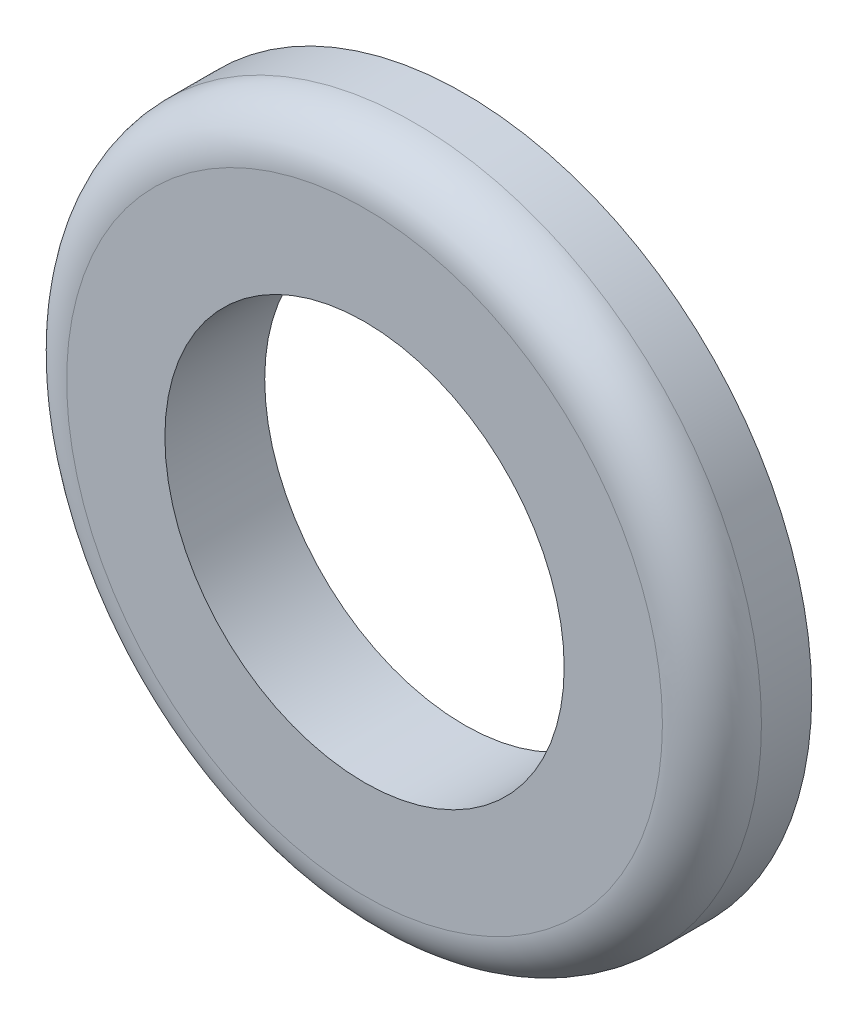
ISO-10303-21;
HEADER;
FILE_DESCRIPTION(('STEP AP214'),'2;1');
FILE_NAME('part.step','',(''),(''),'','','');
FILE_SCHEMA(('AUTOMOTIVE_DESIGN { 1 0 10303 214 1 1 1 1 }'));
ENDSEC;
DATA;
#1=APPLICATION_CONTEXT('core data for automotive mechanical design processes');
#2=APPLICATION_PROTOCOL_DEFINITION('international standard','automotive_design',2000,#1);
#3=PRODUCT_CONTEXT('',#1,'mechanical');
#4=PRODUCT('Part','Part','',(#3));
#5=PRODUCT_RELATED_PRODUCT_CATEGORY('part','',(#4));
#6=PRODUCT_DEFINITION_FORMATION('','',#4);
#7=PRODUCT_DEFINITION_CONTEXT('part definition',#1,'design');
#8=PRODUCT_DEFINITION('design','',#6,#7);
#9=PRODUCT_DEFINITION_SHAPE('','',#8);
#10=(LENGTH_UNIT() NAMED_UNIT(*) SI_UNIT(.MILLI.,.METRE.));
#11=(NAMED_UNIT(*) PLANE_ANGLE_UNIT() SI_UNIT($,.RADIAN.));
#12=(NAMED_UNIT(*) SI_UNIT($,.STERADIAN.) SOLID_ANGLE_UNIT());
#13=UNCERTAINTY_MEASURE_WITH_UNIT(LENGTH_MEASURE(1.E-05),#10,'distance_accuracy_value','');
#14=(GEOMETRIC_REPRESENTATION_CONTEXT(3) GLOBAL_UNCERTAINTY_ASSIGNED_CONTEXT((#13)) GLOBAL_UNIT_ASSIGNED_CONTEXT((#10,
#11,#12)) REPRESENTATION_CONTEXT('',''));
#15=CARTESIAN_POINT('',(0.,0.,0.));
#16=DIRECTION('',(0.,0.,1.));
#17=DIRECTION('',(1.,0.,0.));
#18=AXIS2_PLACEMENT_3D('',#15,#16,#17);
#19=CARTESIAN_POINT('',(0.,0.,1.5875));
#20=DIRECTION('',(0.,0.,1.));
#21=DIRECTION('',(1.,0.,0.));
#22=AXIS2_PLACEMENT_3D('',#19,#20,#21);
#23=PLANE('',#22);
#24=CARTESIAN_POINT('',(0.,0.,1.5875));
#25=DIRECTION('',(0.,0.,1.));
#26=DIRECTION('',(1.,0.,0.));
#27=AXIS2_PLACEMENT_3D('',#24,#25,#26);
#28=CIRCLE('',#27,4.7371);
#29=CARTESIAN_POINT('',(4.7371,0.,1.5875));
#30=VERTEX_POINT('',#29);
#31=EDGE_CURVE('E39',#30,#30,#28,.T.);
#32=ORIENTED_EDGE('',*,*,#31,.T.);
#33=EDGE_LOOP('',(#32));
#34=FACE_BOUND('',#33,.T.);
#35=CARTESIAN_POINT('',(0.,0.,1.5875));
#36=DIRECTION('',(0.,0.,1.));
#37=DIRECTION('',(1.,0.,0.));
#38=AXIS2_PLACEMENT_3D('',#35,#36,#37);
#39=CIRCLE('',#38,3.175);
#40=CARTESIAN_POINT('',(3.175,0.,1.5875));
#41=VERTEX_POINT('',#40);
#42=EDGE_CURVE('E47',#41,#41,#39,.T.);
#43=ORIENTED_EDGE('',*,*,#42,.F.);
#44=EDGE_LOOP('',(#43));
#45=FACE_BOUND('',#44,.T.);
#46=ADVANCED_FACE('F32',(#34,#45),#23,.T.);
#47=CARTESIAN_POINT('',(0.,0.,0.));
#48=DIRECTION('',(0.,0.,1.));
#49=DIRECTION('',(1.,0.,0.));
#50=AXIS2_PLACEMENT_3D('',#47,#48,#49);
#51=PLANE('',#50);
#52=CARTESIAN_POINT('',(0.,0.,0.));
#53=DIRECTION('',(0.,0.,1.));
#54=DIRECTION('',(1.,0.,0.));
#55=AXIS2_PLACEMENT_3D('',#52,#53,#54);
#56=CIRCLE('',#55,5.5245);
#57=CARTESIAN_POINT('',(5.5245,0.,0.));
#58=VERTEX_POINT('',#57);
#59=EDGE_CURVE('E43',#58,#58,#56,.T.);
#60=ORIENTED_EDGE('',*,*,#59,.F.);
#61=EDGE_LOOP('',(#60));
#62=FACE_BOUND('',#61,.T.);
#63=CARTESIAN_POINT('',(0.,0.,0.));
#64=DIRECTION('',(0.,0.,1.));
#65=DIRECTION('',(1.,0.,0.));
#66=AXIS2_PLACEMENT_3D('',#63,#64,#65);
#67=CIRCLE('',#66,3.175);
#68=CARTESIAN_POINT('',(3.175,0.,0.));
#69=VERTEX_POINT('',#68);
#70=EDGE_CURVE('E50',#69,#69,#67,.T.);
#71=ORIENTED_EDGE('',*,*,#70,.T.);
#72=EDGE_LOOP('',(#71));
#73=FACE_BOUND('',#72,.T.);
#74=ADVANCED_FACE('F60',(#62,#73),#51,.F.);
#75=CARTESIAN_POINT('',(0.,0.,1.5875));
#76=DIRECTION('',(0.,0.,-1.));
#77=DIRECTION('',(-1.,0.,0.));
#78=AXIS2_PLACEMENT_3D('',#75,#76,#77);
#79=CYLINDRICAL_SURFACE('',#78,5.5245);
#80=CARTESIAN_POINT('',(0.,0.,0.8001));
#81=DIRECTION('',(0.,0.,1.));
#82=DIRECTION('',(1.,0.,0.));
#83=AXIS2_PLACEMENT_3D('',#80,#81,#82);
#84=CIRCLE('',#83,5.5245);
#85=CARTESIAN_POINT('',(5.5245,0.,0.8001));
#86=VERTEX_POINT('',#85);
#87=EDGE_CURVE('E10',#86,#86,#84,.F.);
#88=ORIENTED_EDGE('',*,*,#87,.T.);
#89=EDGE_LOOP('',(#88));
#90=FACE_BOUND('',#89,.T.);
#91=ORIENTED_EDGE('',*,*,#59,.T.);
#92=EDGE_LOOP('',(#91));
#93=FACE_BOUND('',#92,.T.);
#94=ADVANCED_FACE('F65',(#90,#93),#79,.T.);
#95=CARTESIAN_POINT('',(0.,0.,1.5875));
#96=DIRECTION('',(0.,0.,-1.));
#97=DIRECTION('',(-1.,0.,0.));
#98=AXIS2_PLACEMENT_3D('',#95,#96,#97);
#99=CYLINDRICAL_SURFACE('',#98,3.175);
#100=ORIENTED_EDGE('',*,*,#42,.T.);
#101=EDGE_LOOP('',(#100));
#102=FACE_BOUND('',#101,.T.);
#103=ORIENTED_EDGE('',*,*,#70,.F.);
#104=EDGE_LOOP('',(#103));
#105=FACE_BOUND('',#104,.T.);
#106=ADVANCED_FACE('F56',(#102,#105),#99,.F.);
#107=CARTESIAN_POINT('',(0.,0.,0.8001));
#108=DIRECTION('',(0.,0.,1.));
#109=DIRECTION('',(1.,0.,0.));
#110=AXIS2_PLACEMENT_3D('',#107,#108,#109);
#111=TOROIDAL_SURFACE('',#110,4.7371,0.7874);
#112=ORIENTED_EDGE('',*,*,#87,.F.);
#113=EDGE_LOOP('',(#112));
#114=FACE_BOUND('',#113,.T.);
#115=ORIENTED_EDGE('',*,*,#31,.F.);
#116=EDGE_LOOP('',(#115));
#117=FACE_BOUND('',#116,.T.);
#118=ADVANCED_FACE('F34',(#114,#117),#111,.T.);
#119=CLOSED_SHELL('',(#46,#74,#94,#106,#118));
#120=MANIFOLD_SOLID_BREP('B2',#119);
#121=ADVANCED_BREP_SHAPE_REPRESENTATION('',(#18,#120),#14);
#122=SHAPE_DEFINITION_REPRESENTATION(#9,#121);
ENDSEC;
END-ISO-10303-21;
